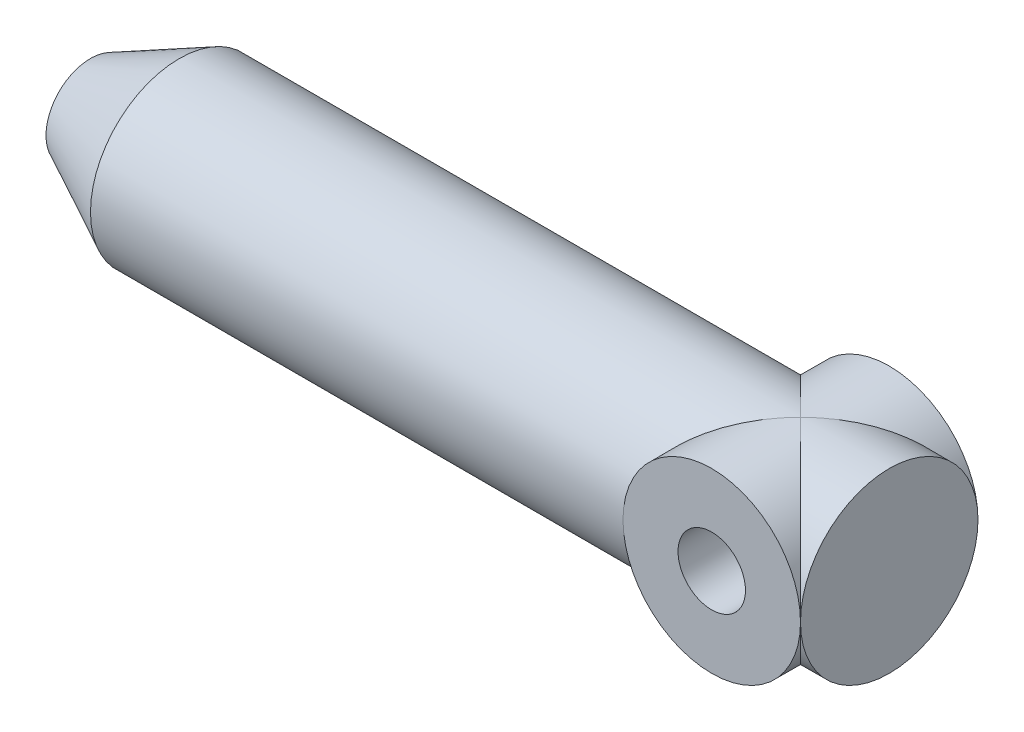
ISO-10303-21;
HEADER;
FILE_DESCRIPTION(('STEP AP214'),'2;1');
FILE_NAME('part.step','',(''),(''),'','','');
FILE_SCHEMA(('AUTOMOTIVE_DESIGN { 1 0 10303 214 1 1 1 1 }'));
ENDSEC;
DATA;
#1=APPLICATION_CONTEXT('core data for automotive mechanical design processes');
#2=APPLICATION_PROTOCOL_DEFINITION('international standard','automotive_design',2000,#1);
#3=PRODUCT_CONTEXT('',#1,'mechanical');
#4=PRODUCT('Part','Part','',(#3));
#5=PRODUCT_RELATED_PRODUCT_CATEGORY('part','',(#4));
#6=PRODUCT_DEFINITION_FORMATION('','',#4);
#7=PRODUCT_DEFINITION_CONTEXT('part definition',#1,'design');
#8=PRODUCT_DEFINITION('design','',#6,#7);
#9=PRODUCT_DEFINITION_SHAPE('','',#8);
#10=(LENGTH_UNIT() NAMED_UNIT(*) SI_UNIT(.MILLI.,.METRE.));
#11=(NAMED_UNIT(*) PLANE_ANGLE_UNIT() SI_UNIT($,.RADIAN.));
#12=(NAMED_UNIT(*) SI_UNIT($,.STERADIAN.) SOLID_ANGLE_UNIT());
#13=UNCERTAINTY_MEASURE_WITH_UNIT(LENGTH_MEASURE(1.E-05),#10,'distance_accuracy_value','');
#14=(GEOMETRIC_REPRESENTATION_CONTEXT(3) GLOBAL_UNCERTAINTY_ASSIGNED_CONTEXT((#13)) GLOBAL_UNIT_ASSIGNED_CONTEXT((#10,
#11,#12)) REPRESENTATION_CONTEXT('',''));
#15=CARTESIAN_POINT('',(0.,0.,0.));
#16=DIRECTION('',(0.,0.,1.));
#17=DIRECTION('',(1.,0.,0.));
#18=AXIS2_PLACEMENT_3D('',#15,#16,#17);
#19=CARTESIAN_POINT('',(0.,0.,0.));
#20=DIRECTION('',(-1.,0.,0.));
#21=DIRECTION('',(0.,0.,1.));
#22=AXIS2_PLACEMENT_3D('',#19,#20,#21);
#23=CYLINDRICAL_SURFACE('',#22,6.35);
#24=CARTESIAN_POINT('',(6.35,0.,0.));
#25=DIRECTION('',(-1.,0.,0.));
#26=DIRECTION('',(0.,0.,1.));
#27=AXIS2_PLACEMENT_3D('',#24,#25,#26);
#28=CIRCLE('',#27,6.35);
#29=CARTESIAN_POINT('',(6.35,0.,6.35));
#30=VERTEX_POINT('',#29);
#31=EDGE_CURVE('E40',#30,#30,#28,.T.);
#32=ORIENTED_EDGE('',*,*,#31,.F.);
#33=EDGE_LOOP('',(#32));
#34=FACE_BOUND('',#33,.T.);
#35=CARTESIAN_POINT('',(50.8,0.,0.));
#36=DIRECTION('',(-0.707106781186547,0.,0.707106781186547));
#37=DIRECTION('',(-0.707106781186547,0.,-0.707106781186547));
#38=AXIS2_PLACEMENT_3D('',#35,#36,#37);
#39=ELLIPSE('',#38,8.98025612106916,6.35);
#40=CARTESIAN_POINT('',(50.8,-6.35,0.));
#41=VERTEX_POINT('',#40);
#42=CARTESIAN_POINT('',(44.45,0.,-6.34999999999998));
#43=VERTEX_POINT('',#42);
#44=EDGE_CURVE('E99',#41,#43,#39,.F.);
#45=ORIENTED_EDGE('',*,*,#44,.F.);
#46=CARTESIAN_POINT('',(50.8,0.,0.));
#47=DIRECTION('',(-0.707106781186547,0.,-0.707106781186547));
#48=DIRECTION('',(-0.707106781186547,0.,0.707106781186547));
#49=AXIS2_PLACEMENT_3D('',#46,#47,#48);
#50=ELLIPSE('',#49,8.98025612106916,6.35);
#51=CARTESIAN_POINT('',(44.45,0.,6.34999999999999));
#52=VERTEX_POINT('',#51);
#53=EDGE_CURVE('E54',#52,#41,#50,.F.);
#54=ORIENTED_EDGE('',*,*,#53,.F.);
#55=CARTESIAN_POINT('',(50.8,6.35,0.));
#56=VERTEX_POINT('',#55);
#57=EDGE_CURVE('E105',#56,#52,#50,.F.);
#58=ORIENTED_EDGE('',*,*,#57,.F.);
#59=EDGE_CURVE('E47',#43,#56,#39,.F.);
#60=ORIENTED_EDGE('',*,*,#59,.F.);
#61=EDGE_LOOP('',(#45,#54,#58,#60));
#62=FACE_BOUND('',#61,.T.);
#63=ADVANCED_FACE('F32',(#34,#62),#23,.T.);
#64=CARTESIAN_POINT('',(0.,3.18262,0.));
#65=DIRECTION('',(1.,0.,0.));
#66=DIRECTION('',(0.,0.,-1.));
#67=AXIS2_PLACEMENT_3D('',#64,#65,#66);
#68=PLANE('',#67);
#69=CARTESIAN_POINT('',(0.,0.,0.));
#70=DIRECTION('',(-1.,0.,0.));
#71=DIRECTION('',(0.,0.,1.));
#72=AXIS2_PLACEMENT_3D('',#69,#70,#71);
#73=CIRCLE('',#72,3.175);
#74=CARTESIAN_POINT('',(0.,0.,3.175));
#75=VERTEX_POINT('',#74);
#76=EDGE_CURVE('E98',#75,#75,#73,.T.);
#77=ORIENTED_EDGE('',*,*,#76,.F.);
#78=EDGE_LOOP('',(#77));
#79=FACE_BOUND('',#78,.T.);
#80=CARTESIAN_POINT('',(0.,0.,0.));
#81=DIRECTION('',(-1.,0.,0.));
#82=DIRECTION('',(0.,0.,1.));
#83=AXIS2_PLACEMENT_3D('',#80,#81,#82);
#84=CIRCLE('',#83,3.18262);
#85=CARTESIAN_POINT('',(0.,0.,3.18262));
#86=VERTEX_POINT('',#85);
#87=EDGE_CURVE('E11',#86,#86,#84,.T.);
#88=ORIENTED_EDGE('',*,*,#87,.T.);
#89=EDGE_LOOP('',(#88));
#90=FACE_BOUND('',#89,.T.);
#91=ADVANCED_FACE('F34',(#79,#90),#68,.F.);
#92=CARTESIAN_POINT('',(6.35,0.,0.));
#93=DIRECTION('',(1.,0.,0.));
#94=DIRECTION('',(0.,0.,-1.));
#95=AXIS2_PLACEMENT_3D('',#92,#93,#94);
#96=CONICAL_SURFACE('',#95,6.35,0.462687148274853);
#97=ORIENTED_EDGE('',*,*,#87,.F.);
#98=EDGE_LOOP('',(#97));
#99=FACE_BOUND('',#98,.T.);
#100=ORIENTED_EDGE('',*,*,#31,.T.);
#101=EDGE_LOOP('',(#100));
#102=FACE_BOUND('',#101,.T.);
#103=ADVANCED_FACE('F121',(#99,#102),#96,.T.);
#104=CARTESIAN_POINT('',(44.45,0.,0.));
#105=DIRECTION('',(-1.,0.,0.));
#106=DIRECTION('',(0.,0.,1.));
#107=AXIS2_PLACEMENT_3D('',#104,#105,#106);
#108=CYLINDRICAL_SURFACE('',#107,3.175);
#109=CARTESIAN_POINT('',(44.45,0.,0.));
#110=DIRECTION('',(-1.,0.,0.));
#111=DIRECTION('',(0.,0.,1.));
#112=AXIS2_PLACEMENT_3D('',#109,#110,#111);
#113=CIRCLE('',#112,3.175);
#114=CARTESIAN_POINT('',(44.45,0.,3.175));
#115=VERTEX_POINT('',#114);
#116=EDGE_CURVE('E89',#115,#115,#113,.T.);
#117=ORIENTED_EDGE('',*,*,#116,.F.);
#118=EDGE_LOOP('',(#117));
#119=FACE_BOUND('',#118,.T.);
#120=ORIENTED_EDGE('',*,*,#76,.T.);
#121=EDGE_LOOP('',(#120));
#122=FACE_BOUND('',#121,.T.);
#123=ADVANCED_FACE('F175',(#119,#122),#108,.F.);
#124=CARTESIAN_POINT('',(44.45,0.,0.));
#125=DIRECTION('',(-1.,0.,0.));
#126=DIRECTION('',(0.,0.,1.));
#127=AXIS2_PLACEMENT_3D('',#124,#125,#126);
#128=PLANE('',#127);
#129=ORIENTED_EDGE('',*,*,#116,.T.);
#130=EDGE_LOOP('',(#129));
#131=FACE_BOUND('',#130,.T.);
#132=ADVANCED_FACE('F141',(#131),#128,.T.);
#133=CARTESIAN_POINT('',(50.8,0.,-6.34999999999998));
#134=DIRECTION('',(0.,0.,1.));
#135=DIRECTION('',(1.,0.,0.));
#136=AXIS2_PLACEMENT_3D('',#133,#134,#135);
#137=PLANE('',#136);
#138=CARTESIAN_POINT('',(50.8,0.,-6.35));
#139=DIRECTION('',(0.,0.,1.));
#140=DIRECTION('',(1.,0.,0.));
#141=AXIS2_PLACEMENT_3D('',#138,#139,#140);
#142=CIRCLE('',#141,2.413);
#143=CARTESIAN_POINT('',(53.213,0.,-6.35));
#144=VERTEX_POINT('',#143);
#145=EDGE_CURVE('E132',#144,#144,#142,.T.);
#146=ORIENTED_EDGE('',*,*,#145,.T.);
#147=EDGE_LOOP('',(#146));
#148=FACE_BOUND('',#147,.T.);
#149=CARTESIAN_POINT('',(50.8,0.,-6.34999999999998));
#150=DIRECTION('',(0.,0.,1.));
#151=DIRECTION('',(1.,0.,0.));
#152=AXIS2_PLACEMENT_3D('',#149,#150,#151);
#153=CIRCLE('',#152,6.35);
#154=CARTESIAN_POINT('',(57.15,0.,-6.34999999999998));
#155=VERTEX_POINT('',#154);
#156=EDGE_CURVE('E102',#155,#43,#153,.T.);
#157=ORIENTED_EDGE('',*,*,#156,.F.);
#158=EDGE_CURVE('E110',#43,#155,#153,.T.);
#159=ORIENTED_EDGE('',*,*,#158,.F.);
#160=EDGE_LOOP('',(#157,#159));
#161=FACE_BOUND('',#160,.T.);
#162=ADVANCED_FACE('F133',(#148,#161),#137,.F.);
#163=CARTESIAN_POINT('',(50.8,0.,6.34999999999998));
#164=DIRECTION('',(0.,0.,-1.));
#165=DIRECTION('',(-1.,0.,0.));
#166=AXIS2_PLACEMENT_3D('',#163,#164,#165);
#167=CYLINDRICAL_SURFACE('',#166,6.35);
#168=ORIENTED_EDGE('',*,*,#156,.T.);
#169=ORIENTED_EDGE('',*,*,#59,.T.);
#170=CARTESIAN_POINT('',(50.8,0.,0.));
#171=DIRECTION('',(-0.707106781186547,0.,-0.707106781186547));
#172=DIRECTION('',(-0.707106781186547,0.,0.707106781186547));
#173=AXIS2_PLACEMENT_3D('',#170,#171,#172);
#174=ELLIPSE('',#173,8.98025612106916,6.35);
#175=EDGE_CURVE('E75',#56,#155,#174,.T.);
#176=ORIENTED_EDGE('',*,*,#175,.T.);
#177=EDGE_LOOP('',(#168,#169,#176));
#178=FACE_BOUND('',#177,.T.);
#179=ADVANCED_FACE('F134',(#178),#167,.T.);
#180=EDGE_CURVE('E78',#155,#41,#174,.T.);
#181=ORIENTED_EDGE('',*,*,#180,.T.);
#182=ORIENTED_EDGE('',*,*,#44,.T.);
#183=ORIENTED_EDGE('',*,*,#158,.T.);
#184=EDGE_LOOP('',(#181,#182,#183));
#185=FACE_BOUND('',#184,.T.);
#186=ADVANCED_FACE('F129',(#185),#167,.T.);
#187=CARTESIAN_POINT('',(50.8,0.,6.34999999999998));
#188=DIRECTION('',(0.,0.,1.));
#189=DIRECTION('',(1.,0.,0.));
#190=AXIS2_PLACEMENT_3D('',#187,#188,#189);
#191=PLANE('',#190);
#192=CARTESIAN_POINT('',(50.8,0.,6.34999999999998));
#193=DIRECTION('',(0.,0.,1.));
#194=DIRECTION('',(1.,0.,0.));
#195=AXIS2_PLACEMENT_3D('',#192,#193,#194);
#196=CIRCLE('',#195,2.413);
#197=CARTESIAN_POINT('',(53.213,0.,6.34999999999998));
#198=VERTEX_POINT('',#197);
#199=EDGE_CURVE('E108',#198,#198,#196,.T.);
#200=ORIENTED_EDGE('',*,*,#199,.F.);
#201=EDGE_LOOP('',(#200));
#202=FACE_BOUND('',#201,.T.);
#203=CARTESIAN_POINT('',(50.8,0.,6.34999999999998));
#204=DIRECTION('',(0.,0.,1.));
#205=DIRECTION('',(1.,0.,0.));
#206=AXIS2_PLACEMENT_3D('',#203,#204,#205);
#207=CIRCLE('',#206,6.35);
#208=CARTESIAN_POINT('',(57.15,0.,6.34999999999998));
#209=VERTEX_POINT('',#208);
#210=EDGE_CURVE('E79',#209,#52,#207,.T.);
#211=ORIENTED_EDGE('',*,*,#210,.T.);
#212=EDGE_CURVE('E96',#52,#209,#207,.T.);
#213=ORIENTED_EDGE('',*,*,#212,.T.);
#214=EDGE_LOOP('',(#211,#213));
#215=FACE_BOUND('',#214,.T.);
#216=ADVANCED_FACE('F101',(#202,#215),#191,.T.);
#217=ORIENTED_EDGE('',*,*,#53,.T.);
#218=CARTESIAN_POINT('',(50.8,0.,0.));
#219=DIRECTION('',(-0.707106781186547,0.,0.707106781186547));
#220=DIRECTION('',(-0.707106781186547,0.,-0.707106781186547));
#221=AXIS2_PLACEMENT_3D('',#218,#219,#220);
#222=ELLIPSE('',#221,8.98025612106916,6.35);
#223=EDGE_CURVE('E81',#41,#209,#222,.T.);
#224=ORIENTED_EDGE('',*,*,#223,.T.);
#225=ORIENTED_EDGE('',*,*,#212,.F.);
#226=EDGE_LOOP('',(#217,#224,#225));
#227=FACE_BOUND('',#226,.T.);
#228=ADVANCED_FACE('F95',(#227),#167,.T.);
#229=EDGE_CURVE('E70',#209,#56,#222,.T.);
#230=ORIENTED_EDGE('',*,*,#229,.T.);
#231=ORIENTED_EDGE('',*,*,#57,.T.);
#232=ORIENTED_EDGE('',*,*,#210,.F.);
#233=EDGE_LOOP('',(#230,#231,#232));
#234=FACE_BOUND('',#233,.T.);
#235=ADVANCED_FACE('F104',(#234),#167,.T.);
#236=ORIENTED_EDGE('',*,*,#175,.F.);
#237=ORIENTED_EDGE('',*,*,#229,.F.);
#238=CARTESIAN_POINT('',(57.15,0.,0.));
#239=DIRECTION('',(-1.,0.,0.));
#240=DIRECTION('',(0.,0.,1.));
#241=AXIS2_PLACEMENT_3D('',#238,#239,#240);
#242=CIRCLE('',#241,6.35);
#243=EDGE_CURVE('E74',#209,#155,#242,.T.);
#244=ORIENTED_EDGE('',*,*,#243,.T.);
#245=EDGE_LOOP('',(#236,#237,#244));
#246=FACE_BOUND('',#245,.T.);
#247=ADVANCED_FACE('F72',(#246),#23,.T.);
#248=CARTESIAN_POINT('',(57.15,6.35,0.));
#249=DIRECTION('',(-1.,0.,0.));
#250=DIRECTION('',(0.,0.,1.));
#251=AXIS2_PLACEMENT_3D('',#248,#249,#250);
#252=PLANE('',#251);
#253=EDGE_CURVE('E84',#155,#209,#242,.T.);
#254=ORIENTED_EDGE('',*,*,#253,.F.);
#255=ORIENTED_EDGE('',*,*,#243,.F.);
#256=EDGE_LOOP('',(#254,#255));
#257=FACE_BOUND('',#256,.T.);
#258=ADVANCED_FACE('F91',(#257),#252,.F.);
#259=ORIENTED_EDGE('',*,*,#180,.F.);
#260=ORIENTED_EDGE('',*,*,#253,.T.);
#261=ORIENTED_EDGE('',*,*,#223,.F.);
#262=EDGE_LOOP('',(#259,#260,#261));
#263=FACE_BOUND('',#262,.T.);
#264=ADVANCED_FACE('F85',(#263),#23,.T.);
#265=CARTESIAN_POINT('',(50.8,0.,-6.35));
#266=DIRECTION('',(0.,0.,1.));
#267=DIRECTION('',(1.,0.,0.));
#268=AXIS2_PLACEMENT_3D('',#265,#266,#267);
#269=CYLINDRICAL_SURFACE('',#268,2.413);
#270=ORIENTED_EDGE('',*,*,#145,.F.);
#271=EDGE_LOOP('',(#270));
#272=FACE_BOUND('',#271,.T.);
#273=ORIENTED_EDGE('',*,*,#199,.T.);
#274=EDGE_LOOP('',(#273));
#275=FACE_BOUND('',#274,.T.);
#276=ADVANCED_FACE('F159',(#272,#275),#269,.F.);
#277=CLOSED_SHELL('',(#63,#91,#103,#123,#132,#162,#179,#186,#216,#228,#235,#247,#258,#264,#276));
#278=MANIFOLD_SOLID_BREP('B2',#277);
#279=ADVANCED_BREP_SHAPE_REPRESENTATION('',(#18,#278),#14);
#280=SHAPE_DEFINITION_REPRESENTATION(#9,#279);
ENDSEC;
END-ISO-10303-21;
